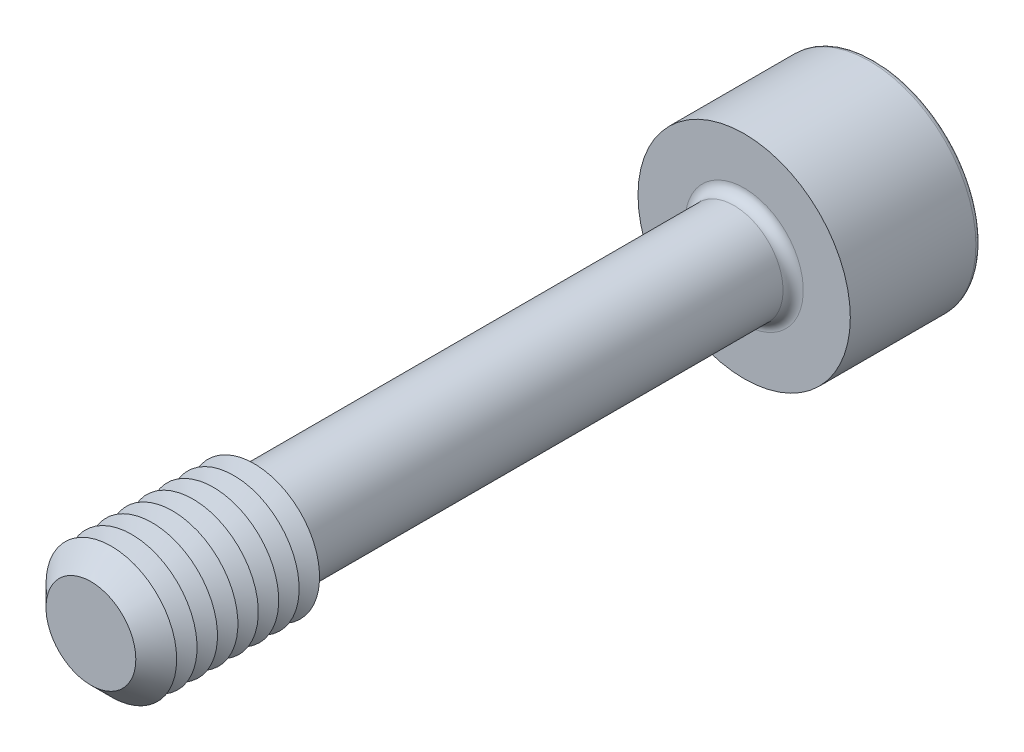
ISO-10303-21;
HEADER;
FILE_DESCRIPTION(('STEP AP214'),'2;1');
FILE_NAME('part.step','',(''),(''),'','','');
FILE_SCHEMA(('AUTOMOTIVE_DESIGN { 1 0 10303 214 1 1 1 1 }'));
ENDSEC;
DATA;
#1=APPLICATION_CONTEXT('core data for automotive mechanical design processes');
#2=APPLICATION_PROTOCOL_DEFINITION('international standard','automotive_design',2000,#1);
#3=PRODUCT_CONTEXT('',#1,'mechanical');
#4=PRODUCT('Part','Part','',(#3));
#5=PRODUCT_RELATED_PRODUCT_CATEGORY('part','',(#4));
#6=PRODUCT_DEFINITION_FORMATION('','',#4);
#7=PRODUCT_DEFINITION_CONTEXT('part definition',#1,'design');
#8=PRODUCT_DEFINITION('design','',#6,#7);
#9=PRODUCT_DEFINITION_SHAPE('','',#8);
#10=(LENGTH_UNIT() NAMED_UNIT(*) SI_UNIT(.MILLI.,.METRE.));
#11=(NAMED_UNIT(*) PLANE_ANGLE_UNIT() SI_UNIT($,.RADIAN.));
#12=(NAMED_UNIT(*) SI_UNIT($,.STERADIAN.) SOLID_ANGLE_UNIT());
#13=UNCERTAINTY_MEASURE_WITH_UNIT(LENGTH_MEASURE(1.E-05),#10,'distance_accuracy_value','');
#14=(GEOMETRIC_REPRESENTATION_CONTEXT(3) GLOBAL_UNCERTAINTY_ASSIGNED_CONTEXT((#13)) GLOBAL_UNIT_ASSIGNED_CONTEXT((#10,
#11,#12)) REPRESENTATION_CONTEXT('',''));
#15=CARTESIAN_POINT('',(0.,0.,0.));
#16=DIRECTION('',(0.,0.,1.));
#17=DIRECTION('',(1.,0.,0.));
#18=AXIS2_PLACEMENT_3D('',#15,#16,#17);
#19=CARTESIAN_POINT('',(-1.73205080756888,-3.,-22.));
#20=DIRECTION('',(0.,0.,1.));
#21=DIRECTION('',(1.,0.,0.));
#22=AXIS2_PLACEMENT_3D('',#19,#20,#21);
#23=PLANE('',#22);
#24=DIRECTION('',(1.,0.,0.));
#25=VECTOR('',#24,1.);
#26=CARTESIAN_POINT('',(-1.73205080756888,-3.,-22.));
#27=LINE('',#26,#25);
#28=CARTESIAN_POINT('',(0.,-3.,-22.));
#29=VERTEX_POINT('',#28);
#30=CARTESIAN_POINT('',(1.73205080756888,-3.,-22.));
#31=VERTEX_POINT('',#30);
#32=EDGE_CURVE('E404',#29,#31,#27,.T.);
#33=ORIENTED_EDGE('',*,*,#32,.F.);
#34=CARTESIAN_POINT('',(0.,0.,-22.));
#35=DIRECTION('',(0.,0.,1.));
#36=DIRECTION('',(0.,-1.,0.));
#37=AXIS2_PLACEMENT_3D('',#34,#35,#36);
#38=CIRCLE('',#37,3.);
#39=CARTESIAN_POINT('',(2.59807621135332,-1.5,-22.));
#40=VERTEX_POINT('',#39);
#41=EDGE_CURVE('E53',#29,#40,#38,.T.);
#42=ORIENTED_EDGE('',*,*,#41,.T.);
#43=DIRECTION('',(0.5,0.866025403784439,0.));
#44=VECTOR('',#43,1.);
#45=CARTESIAN_POINT('',(1.73205080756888,-3.,-22.));
#46=LINE('',#45,#44);
#47=EDGE_CURVE('E395',#31,#40,#46,.T.);
#48=ORIENTED_EDGE('',*,*,#47,.F.);
#49=EDGE_LOOP('',(#33,#42,#48));
#50=FACE_BOUND('',#49,.T.);
#51=ADVANCED_FACE('F41',(#50),#23,.F.);
#52=CARTESIAN_POINT('',(3.46410161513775,0.,-22.));
#53=VERTEX_POINT('',#52);
#54=EDGE_CURVE('E399',#40,#53,#46,.T.);
#55=ORIENTED_EDGE('',*,*,#54,.F.);
#56=CARTESIAN_POINT('',(2.59807621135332,1.5,-22.));
#57=VERTEX_POINT('',#56);
#58=EDGE_CURVE('E11',#40,#57,#38,.T.);
#59=ORIENTED_EDGE('',*,*,#58,.T.);
#60=DIRECTION('',(-0.5,0.866025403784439,0.));
#61=VECTOR('',#60,1.);
#62=CARTESIAN_POINT('',(3.46410161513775,0.,-22.));
#63=LINE('',#62,#61);
#64=EDGE_CURVE('E391',#53,#57,#63,.T.);
#65=ORIENTED_EDGE('',*,*,#64,.F.);
#66=EDGE_LOOP('',(#55,#59,#65));
#67=FACE_BOUND('',#66,.T.);
#68=ADVANCED_FACE('F133',(#67),#23,.F.);
#69=CARTESIAN_POINT('',(1.73205080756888,3.,-22.));
#70=VERTEX_POINT('',#69);
#71=EDGE_CURVE('E390',#57,#70,#63,.T.);
#72=ORIENTED_EDGE('',*,*,#71,.F.);
#73=CARTESIAN_POINT('',(0.,3.,-22.));
#74=VERTEX_POINT('',#73);
#75=EDGE_CURVE('E51',#57,#74,#38,.T.);
#76=ORIENTED_EDGE('',*,*,#75,.T.);
#77=DIRECTION('',(-1.,0.,0.));
#78=VECTOR('',#77,1.);
#79=CARTESIAN_POINT('',(1.73205080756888,3.,-22.));
#80=LINE('',#79,#78);
#81=EDGE_CURVE('E177',#70,#74,#80,.T.);
#82=ORIENTED_EDGE('',*,*,#81,.F.);
#83=EDGE_LOOP('',(#72,#76,#82));
#84=FACE_BOUND('',#83,.T.);
#85=ADVANCED_FACE('F139',(#84),#23,.F.);
#86=CARTESIAN_POINT('',(-1.73205080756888,3.,-22.));
#87=VERTEX_POINT('',#86);
#88=EDGE_CURVE('E396',#74,#87,#80,.T.);
#89=ORIENTED_EDGE('',*,*,#88,.F.);
#90=CARTESIAN_POINT('',(-2.59807621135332,1.5,-22.));
#91=VERTEX_POINT('',#90);
#92=EDGE_CURVE('E265',#74,#91,#38,.T.);
#93=ORIENTED_EDGE('',*,*,#92,.T.);
#94=DIRECTION('',(-0.5,-0.866025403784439,0.));
#95=VECTOR('',#94,1.);
#96=CARTESIAN_POINT('',(-1.73205080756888,3.,-22.));
#97=LINE('',#96,#95);
#98=EDGE_CURVE('E176',#87,#91,#97,.T.);
#99=ORIENTED_EDGE('',*,*,#98,.F.);
#100=EDGE_LOOP('',(#89,#93,#99));
#101=FACE_BOUND('',#100,.T.);
#102=ADVANCED_FACE('F157',(#101),#23,.F.);
#103=CARTESIAN_POINT('',(-3.46410161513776,0.,-22.));
#104=VERTEX_POINT('',#103);
#105=EDGE_CURVE('E170',#91,#104,#97,.T.);
#106=ORIENTED_EDGE('',*,*,#105,.F.);
#107=CARTESIAN_POINT('',(-2.59807621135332,-1.5,-22.));
#108=VERTEX_POINT('',#107);
#109=EDGE_CURVE('E172',#91,#108,#38,.T.);
#110=ORIENTED_EDGE('',*,*,#109,.T.);
#111=DIRECTION('',(0.5,-0.866025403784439,0.));
#112=VECTOR('',#111,1.);
#113=CARTESIAN_POINT('',(-3.46410161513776,0.,-22.));
#114=LINE('',#113,#112);
#115=EDGE_CURVE('E174',#104,#108,#114,.T.);
#116=ORIENTED_EDGE('',*,*,#115,.F.);
#117=EDGE_LOOP('',(#106,#110,#116));
#118=FACE_BOUND('',#117,.T.);
#119=ADVANCED_FACE('F146',(#118),#23,.F.);
#120=CARTESIAN_POINT('',(0.,0.,-28.));
#121=DIRECTION('',(0.,0.,-1.));
#122=DIRECTION('',(-1.,0.,0.));
#123=AXIS2_PLACEMENT_3D('',#120,#121,#122);
#124=PLANE('',#123);
#125=CARTESIAN_POINT('',(0.,0.,-28.));
#126=DIRECTION('',(0.,0.,-1.));
#127=DIRECTION('',(-1.,0.,0.));
#128=AXIS2_PLACEMENT_3D('',#125,#126,#127);
#129=CIRCLE('',#128,6.19);
#130=CARTESIAN_POINT('',(-6.19,0.,-28.));
#131=VERTEX_POINT('',#130);
#132=EDGE_CURVE('E248',#131,#131,#129,.T.);
#133=ORIENTED_EDGE('',*,*,#132,.T.);
#134=EDGE_LOOP('',(#133));
#135=FACE_BOUND('',#134,.T.);
#136=DIRECTION('',(-0.5,-0.866025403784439,0.));
#137=VECTOR('',#136,1.);
#138=CARTESIAN_POINT('',(-1.73205080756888,3.,-28.));
#139=LINE('',#138,#137);
#140=CARTESIAN_POINT('',(-1.73205080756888,3.,-28.));
#141=VERTEX_POINT('',#140);
#142=CARTESIAN_POINT('',(-3.46410161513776,0.,-28.));
#143=VERTEX_POINT('',#142);
#144=EDGE_CURVE('E212',#141,#143,#139,.T.);
#145=ORIENTED_EDGE('',*,*,#144,.T.);
#146=DIRECTION('',(0.5,-0.866025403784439,0.));
#147=VECTOR('',#146,1.);
#148=CARTESIAN_POINT('',(-3.46410161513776,0.,-28.));
#149=LINE('',#148,#147);
#150=CARTESIAN_POINT('',(-1.73205080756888,-3.,-28.));
#151=VERTEX_POINT('',#150);
#152=EDGE_CURVE('E67',#143,#151,#149,.T.);
#153=ORIENTED_EDGE('',*,*,#152,.T.);
#154=DIRECTION('',(1.,0.,0.));
#155=VECTOR('',#154,1.);
#156=CARTESIAN_POINT('',(-1.73205080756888,-3.,-28.));
#157=LINE('',#156,#155);
#158=CARTESIAN_POINT('',(1.73205080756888,-3.,-28.));
#159=VERTEX_POINT('',#158);
#160=EDGE_CURVE('E196',#151,#159,#157,.T.);
#161=ORIENTED_EDGE('',*,*,#160,.T.);
#162=DIRECTION('',(0.5,0.866025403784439,0.));
#163=VECTOR('',#162,1.);
#164=CARTESIAN_POINT('',(1.73205080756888,-3.,-28.));
#165=LINE('',#164,#163);
#166=CARTESIAN_POINT('',(3.46410161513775,0.,-28.));
#167=VERTEX_POINT('',#166);
#168=EDGE_CURVE('E200',#159,#167,#165,.T.);
#169=ORIENTED_EDGE('',*,*,#168,.T.);
#170=DIRECTION('',(-0.5,0.866025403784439,0.));
#171=VECTOR('',#170,1.);
#172=CARTESIAN_POINT('',(3.46410161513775,0.,-28.));
#173=LINE('',#172,#171);
#174=CARTESIAN_POINT('',(1.73205080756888,3.,-28.));
#175=VERTEX_POINT('',#174);
#176=EDGE_CURVE('E204',#167,#175,#173,.T.);
#177=ORIENTED_EDGE('',*,*,#176,.T.);
#178=DIRECTION('',(-1.,0.,0.));
#179=VECTOR('',#178,1.);
#180=CARTESIAN_POINT('',(1.73205080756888,3.,-28.));
#181=LINE('',#180,#179);
#182=EDGE_CURVE('E208',#175,#141,#181,.T.);
#183=ORIENTED_EDGE('',*,*,#182,.T.);
#184=EDGE_LOOP('',(#145,#153,#161,#169,#177,#183));
#185=FACE_BOUND('',#184,.T.);
#186=ADVANCED_FACE('F156',(#135,#185),#124,.T.);
#187=CARTESIAN_POINT('',(0.,0.,20.));
#188=DIRECTION('',(0.,0.,-1.));
#189=DIRECTION('',(-1.,0.,0.));
#190=AXIS2_PLACEMENT_3D('',#187,#188,#189);
#191=CYLINDRICAL_SURFACE('',#190,3.);
#192=CARTESIAN_POINT('',(0.,0.,-19.38));
#193=DIRECTION('',(0.,0.,-1.));
#194=DIRECTION('',(-1.,0.,0.));
#195=AXIS2_PLACEMENT_3D('',#192,#193,#194);
#196=CIRCLE('',#195,3.);
#197=CARTESIAN_POINT('',(-3.,0.,-19.38));
#198=VERTEX_POINT('',#197);
#199=EDGE_CURVE('E246',#198,#198,#196,.F.);
#200=ORIENTED_EDGE('',*,*,#199,.T.);
#201=EDGE_LOOP('',(#200));
#202=FACE_BOUND('',#201,.T.);
#203=CARTESIAN_POINT('',(0.,0.,9.42264973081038));
#204=DIRECTION('',(0.,0.,-1.));
#205=DIRECTION('',(0.,1.,0.));
#206=AXIS2_PLACEMENT_3D('',#203,#204,#205);
#207=CIRCLE('',#206,3.);
#208=CARTESIAN_POINT('',(0.,3.,9.42264973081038));
#209=VERTEX_POINT('',#208);
#210=EDGE_CURVE('E234',#209,#209,#207,.T.);
#211=ORIENTED_EDGE('',*,*,#210,.T.);
#212=EDGE_LOOP('',(#211));
#213=FACE_BOUND('',#212,.T.);
#214=ADVANCED_FACE('F163',(#202,#213),#191,.T.);
#215=CARTESIAN_POINT('',(0.,0.,9.42264973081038));
#216=DIRECTION('',(0.,0.,1.));
#217=DIRECTION('',(0.,-1.,0.));
#218=AXIS2_PLACEMENT_3D('',#215,#216,#217);
#219=CONICAL_SURFACE('',#218,3.,1.0471975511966);
#220=CARTESIAN_POINT('',(0.,0.,10.));
#221=DIRECTION('',(0.,0.,-1.));
#222=DIRECTION('',(-1.,0.,0.));
#223=AXIS2_PLACEMENT_3D('',#220,#221,#222);
#224=CIRCLE('',#223,4.);
#225=CARTESIAN_POINT('',(-4.,0.,10.));
#226=VERTEX_POINT('',#225);
#227=EDGE_CURVE('E269',#226,#226,#224,.T.);
#228=ORIENTED_EDGE('',*,*,#227,.T.);
#229=EDGE_LOOP('',(#228));
#230=FACE_BOUND('',#229,.T.);
#231=ORIENTED_EDGE('',*,*,#210,.F.);
#232=EDGE_LOOP('',(#231));
#233=FACE_BOUND('',#232,.T.);
#234=ADVANCED_FACE('F348',(#230,#233),#219,.T.);
#235=CARTESIAN_POINT('',(0.,0.,-20.));
#236=DIRECTION('',(0.,0.,-1.));
#237=DIRECTION('',(-1.,0.,0.));
#238=AXIS2_PLACEMENT_3D('',#235,#236,#237);
#239=PLANE('',#238);
#240=CARTESIAN_POINT('',(0.,0.,-20.));
#241=DIRECTION('',(0.,0.,-1.));
#242=DIRECTION('',(-1.,0.,0.));
#243=AXIS2_PLACEMENT_3D('',#240,#241,#242);
#244=CIRCLE('',#243,3.62);
#245=CARTESIAN_POINT('',(-3.62,0.,-20.));
#246=VERTEX_POINT('',#245);
#247=EDGE_CURVE('E242',#246,#246,#244,.T.);
#248=ORIENTED_EDGE('',*,*,#247,.T.);
#249=EDGE_LOOP('',(#248));
#250=FACE_BOUND('',#249,.T.);
#251=CARTESIAN_POINT('',(0.,0.,-20.));
#252=DIRECTION('',(0.,0.,-1.));
#253=DIRECTION('',(-1.,0.,0.));
#254=AXIS2_PLACEMENT_3D('',#251,#252,#253);
#255=CIRCLE('',#254,6.5);
#256=CARTESIAN_POINT('',(-6.5,0.,-20.));
#257=VERTEX_POINT('',#256);
#258=EDGE_CURVE('E230',#257,#257,#255,.T.);
#259=ORIENTED_EDGE('',*,*,#258,.F.);
#260=EDGE_LOOP('',(#259));
#261=FACE_BOUND('',#260,.T.);
#262=ADVANCED_FACE('F353',(#250,#261),#239,.F.);
#263=CARTESIAN_POINT('',(0.,0.,-28.));
#264=DIRECTION('',(0.,0.,1.));
#265=DIRECTION('',(1.,0.,0.));
#266=AXIS2_PLACEMENT_3D('',#263,#264,#265);
#267=CYLINDRICAL_SURFACE('',#266,6.5);
#268=CARTESIAN_POINT('',(0.,0.,-27.69));
#269=DIRECTION('',(0.,0.,-1.));
#270=DIRECTION('',(-1.,0.,0.));
#271=AXIS2_PLACEMENT_3D('',#268,#269,#270);
#272=CIRCLE('',#271,6.5);
#273=CARTESIAN_POINT('',(-6.5,0.,-27.69));
#274=VERTEX_POINT('',#273);
#275=EDGE_CURVE('E45',#274,#274,#272,.F.);
#276=ORIENTED_EDGE('',*,*,#275,.T.);
#277=EDGE_LOOP('',(#276));
#278=FACE_BOUND('',#277,.T.);
#279=ORIENTED_EDGE('',*,*,#258,.T.);
#280=EDGE_LOOP('',(#279));
#281=FACE_BOUND('',#280,.T.);
#282=ADVANCED_FACE('F354',(#278,#281),#267,.T.);
#283=CARTESIAN_POINT('',(-3.46410161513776,0.,-22.));
#284=DIRECTION('',(0.866025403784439,0.5,0.));
#285=DIRECTION('',(-0.5,0.866025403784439,0.));
#286=AXIS2_PLACEMENT_3D('',#283,#284,#285);
#287=PLANE('',#286);
#288=ORIENTED_EDGE('',*,*,#152,.F.);
#289=DIRECTION('',(0.,0.,-1.));
#290=VECTOR('',#289,1.);
#291=CARTESIAN_POINT('',(-3.46410161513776,0.,-22.));
#292=LINE('',#291,#290);
#293=EDGE_CURVE('E186',#104,#143,#292,.T.);
#294=ORIENTED_EDGE('',*,*,#293,.F.);
#295=ORIENTED_EDGE('',*,*,#115,.T.);
#296=CARTESIAN_POINT('',(-1.73205080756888,-3.,-22.));
#297=VERTEX_POINT('',#296);
#298=EDGE_CURVE('E215',#108,#297,#114,.T.);
#299=ORIENTED_EDGE('',*,*,#298,.T.);
#300=DIRECTION('',(0.,0.,-1.));
#301=VECTOR('',#300,1.);
#302=CARTESIAN_POINT('',(-1.73205080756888,-3.,-22.));
#303=LINE('',#302,#301);
#304=EDGE_CURVE('E227',#297,#151,#303,.T.);
#305=ORIENTED_EDGE('',*,*,#304,.T.);
#306=EDGE_LOOP('',(#288,#294,#295,#299,#305));
#307=FACE_BOUND('',#306,.T.);
#308=ADVANCED_FACE('F357',(#307),#287,.T.);
#309=CARTESIAN_POINT('',(-1.73205080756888,-3.,-22.));
#310=DIRECTION('',(0.,1.,0.));
#311=DIRECTION('',(0.,0.,1.));
#312=AXIS2_PLACEMENT_3D('',#309,#310,#311);
#313=PLANE('',#312);
#314=ORIENTED_EDGE('',*,*,#160,.F.);
#315=ORIENTED_EDGE('',*,*,#304,.F.);
#316=EDGE_CURVE('E402',#297,#29,#27,.T.);
#317=ORIENTED_EDGE('',*,*,#316,.T.);
#318=ORIENTED_EDGE('',*,*,#32,.T.);
#319=DIRECTION('',(0.,0.,-1.));
#320=VECTOR('',#319,1.);
#321=CARTESIAN_POINT('',(1.73205080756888,-3.,-22.));
#322=LINE('',#321,#320);
#323=EDGE_CURVE('E224',#31,#159,#322,.T.);
#324=ORIENTED_EDGE('',*,*,#323,.T.);
#325=EDGE_LOOP('',(#314,#315,#317,#318,#324));
#326=FACE_BOUND('',#325,.T.);
#327=ADVANCED_FACE('F363',(#326),#313,.T.);
#328=CARTESIAN_POINT('',(1.73205080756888,-3.,-22.));
#329=DIRECTION('',(-0.866025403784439,0.5,0.));
#330=DIRECTION('',(-0.5,-0.866025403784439,0.));
#331=AXIS2_PLACEMENT_3D('',#328,#329,#330);
#332=PLANE('',#331);
#333=ORIENTED_EDGE('',*,*,#168,.F.);
#334=ORIENTED_EDGE('',*,*,#323,.F.);
#335=ORIENTED_EDGE('',*,*,#47,.T.);
#336=ORIENTED_EDGE('',*,*,#54,.T.);
#337=DIRECTION('',(0.,0.,-1.));
#338=VECTOR('',#337,1.);
#339=CARTESIAN_POINT('',(3.46410161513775,0.,-22.));
#340=LINE('',#339,#338);
#341=EDGE_CURVE('E221',#53,#167,#340,.T.);
#342=ORIENTED_EDGE('',*,*,#341,.T.);
#343=EDGE_LOOP('',(#333,#334,#335,#336,#342));
#344=FACE_BOUND('',#343,.T.);
#345=ADVANCED_FACE('F366',(#344),#332,.T.);
#346=CARTESIAN_POINT('',(3.46410161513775,0.,-22.));
#347=DIRECTION('',(-0.866025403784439,-0.5,0.));
#348=DIRECTION('',(0.5,-0.866025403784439,0.));
#349=AXIS2_PLACEMENT_3D('',#346,#347,#348);
#350=PLANE('',#349);
#351=ORIENTED_EDGE('',*,*,#176,.F.);
#352=ORIENTED_EDGE('',*,*,#341,.F.);
#353=ORIENTED_EDGE('',*,*,#64,.T.);
#354=ORIENTED_EDGE('',*,*,#71,.T.);
#355=DIRECTION('',(0.,0.,-1.));
#356=VECTOR('',#355,1.);
#357=CARTESIAN_POINT('',(1.73205080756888,3.,-22.));
#358=LINE('',#357,#356);
#359=EDGE_CURVE('E218',#70,#175,#358,.T.);
#360=ORIENTED_EDGE('',*,*,#359,.T.);
#361=EDGE_LOOP('',(#351,#352,#353,#354,#360));
#362=FACE_BOUND('',#361,.T.);
#363=ADVANCED_FACE('F370',(#362),#350,.T.);
#364=CARTESIAN_POINT('',(1.73205080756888,3.,-22.));
#365=DIRECTION('',(0.,-1.,0.));
#366=DIRECTION('',(1.,0.,0.));
#367=AXIS2_PLACEMENT_3D('',#364,#365,#366);
#368=PLANE('',#367);
#369=ORIENTED_EDGE('',*,*,#182,.F.);
#370=ORIENTED_EDGE('',*,*,#359,.F.);
#371=ORIENTED_EDGE('',*,*,#81,.T.);
#372=ORIENTED_EDGE('',*,*,#88,.T.);
#373=DIRECTION('',(0.,0.,-1.));
#374=VECTOR('',#373,1.);
#375=CARTESIAN_POINT('',(-1.73205080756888,3.,-22.));
#376=LINE('',#375,#374);
#377=EDGE_CURVE('E182',#87,#141,#376,.T.);
#378=ORIENTED_EDGE('',*,*,#377,.T.);
#379=EDGE_LOOP('',(#369,#370,#371,#372,#378));
#380=FACE_BOUND('',#379,.T.);
#381=ADVANCED_FACE('F152',(#380),#368,.T.);
#382=CARTESIAN_POINT('',(-1.73205080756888,3.,-22.));
#383=DIRECTION('',(0.866025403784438,-0.5,0.));
#384=DIRECTION('',(0.5,0.866025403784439,0.));
#385=AXIS2_PLACEMENT_3D('',#382,#383,#384);
#386=PLANE('',#385);
#387=ORIENTED_EDGE('',*,*,#144,.F.);
#388=ORIENTED_EDGE('',*,*,#377,.F.);
#389=ORIENTED_EDGE('',*,*,#98,.T.);
#390=ORIENTED_EDGE('',*,*,#105,.T.);
#391=ORIENTED_EDGE('',*,*,#293,.T.);
#392=EDGE_LOOP('',(#387,#388,#389,#390,#391));
#393=FACE_BOUND('',#392,.T.);
#394=ADVANCED_FACE('F144',(#393),#386,.T.);
#395=ORIENTED_EDGE('',*,*,#298,.F.);
#396=EDGE_CURVE('E256',#108,#29,#38,.T.);
#397=ORIENTED_EDGE('',*,*,#396,.T.);
#398=ORIENTED_EDGE('',*,*,#316,.F.);
#399=EDGE_LOOP('',(#395,#397,#398));
#400=FACE_BOUND('',#399,.T.);
#401=ADVANCED_FACE('F135',(#400),#23,.F.);
#402=CARTESIAN_POINT('',(0.,0.,-19.38));
#403=DIRECTION('',(0.,0.,-1.));
#404=DIRECTION('',(-1.,0.,0.));
#405=AXIS2_PLACEMENT_3D('',#402,#403,#404);
#406=TOROIDAL_SURFACE('',#405,3.62,0.62);
#407=ORIENTED_EDGE('',*,*,#199,.F.);
#408=EDGE_LOOP('',(#407));
#409=FACE_BOUND('',#408,.T.);
#410=ORIENTED_EDGE('',*,*,#247,.F.);
#411=EDGE_LOOP('',(#410));
#412=FACE_BOUND('',#411,.T.);
#413=ADVANCED_FACE('F129',(#409,#412),#406,.F.);
#414=CARTESIAN_POINT('',(0.,0.,-27.69));
#415=DIRECTION('',(0.,0.,-1.));
#416=DIRECTION('',(-1.,0.,0.));
#417=AXIS2_PLACEMENT_3D('',#414,#415,#416);
#418=TOROIDAL_SURFACE('',#417,6.19,0.31);
#419=ORIENTED_EDGE('',*,*,#275,.F.);
#420=EDGE_LOOP('',(#419));
#421=FACE_BOUND('',#420,.T.);
#422=ORIENTED_EDGE('',*,*,#132,.F.);
#423=EDGE_LOOP('',(#422));
#424=FACE_BOUND('',#423,.T.);
#425=ADVANCED_FACE('F43',(#421,#424),#418,.T.);
#426=CARTESIAN_POINT('',(0.,0.,-20.2679491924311));
#427=DIRECTION('',(0.,0.,-1.));
#428=DIRECTION('',(0.,1.,0.));
#429=AXIS2_PLACEMENT_3D('',#426,#427,#428);
#430=CONICAL_SURFACE('',#429,0.,1.0471975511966);
#431=ORIENTED_EDGE('',*,*,#41,.F.);
#432=ORIENTED_EDGE('',*,*,#396,.F.);
#433=ORIENTED_EDGE('',*,*,#109,.F.);
#434=ORIENTED_EDGE('',*,*,#92,.F.);
#435=ORIENTED_EDGE('',*,*,#75,.F.);
#436=ORIENTED_EDGE('',*,*,#58,.F.);
#437=EDGE_LOOP('',(#431,#432,#433,#434,#435,#436));
#438=FACE_BOUND('',#437,.T.);
#439=CARTESIAN_POINT('',(0.,0.,-20.2679491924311));
#440=VERTEX_POINT('',#439);
#441=VERTEX_LOOP('',#440);
#442=FACE_BOUND('',#441,.T.);
#443=ADVANCED_FACE('F118',(#438,#442),#430,.F.);
#444=CARTESIAN_POINT('',(0.,0.,10.625));
#445=DIRECTION('',(0.,0.,-1.));
#446=DIRECTION('',(-1.,0.,0.));
#447=AXIS2_PLACEMENT_3D('',#444,#445,#446);
#448=CONICAL_SURFACE('',#447,2.91746824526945,1.0471975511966);
#449=ORIENTED_EDGE('',*,*,#227,.F.);
#450=EDGE_LOOP('',(#449));
#451=FACE_BOUND('',#450,.T.);
#452=CARTESIAN_POINT('',(0.,0.,10.625));
#453=DIRECTION('',(0.,0.,-1.));
#454=DIRECTION('',(-1.,0.,0.));
#455=AXIS2_PLACEMENT_3D('',#452,#453,#454);
#456=CIRCLE('',#455,2.91746824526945);
#457=CARTESIAN_POINT('',(-2.91746824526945,0.,10.625));
#458=VERTEX_POINT('',#457);
#459=EDGE_CURVE('E274',#458,#458,#456,.T.);
#460=ORIENTED_EDGE('',*,*,#459,.T.);
#461=EDGE_LOOP('',(#460));
#462=FACE_BOUND('',#461,.T.);
#463=ADVANCED_FACE('F120',(#451,#462),#448,.T.);
#464=CARTESIAN_POINT('',(0.,0.,11.25));
#465=DIRECTION('',(0.,0.,1.));
#466=DIRECTION('',(1.,0.,0.));
#467=AXIS2_PLACEMENT_3D('',#464,#465,#466);
#468=CONICAL_SURFACE('',#467,4.,1.0471975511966);
#469=ORIENTED_EDGE('',*,*,#459,.F.);
#470=EDGE_LOOP('',(#469));
#471=FACE_BOUND('',#470,.T.);
#472=CARTESIAN_POINT('',(0.,0.,11.25));
#473=DIRECTION('',(0.,0.,-1.));
#474=DIRECTION('',(-1.,0.,0.));
#475=AXIS2_PLACEMENT_3D('',#472,#473,#474);
#476=CIRCLE('',#475,4.);
#477=CARTESIAN_POINT('',(-4.,0.,11.25));
#478=VERTEX_POINT('',#477);
#479=EDGE_CURVE('E280',#478,#478,#476,.T.);
#480=ORIENTED_EDGE('',*,*,#479,.T.);
#481=EDGE_LOOP('',(#480));
#482=FACE_BOUND('',#481,.T.);
#483=ADVANCED_FACE('F126',(#471,#482),#468,.T.);
#484=CARTESIAN_POINT('',(0.,0.,11.875));
#485=DIRECTION('',(0.,0.,-1.));
#486=DIRECTION('',(-1.,0.,0.));
#487=AXIS2_PLACEMENT_3D('',#484,#485,#486);
#488=CONICAL_SURFACE('',#487,2.91746824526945,1.0471975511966);
#489=ORIENTED_EDGE('',*,*,#479,.F.);
#490=EDGE_LOOP('',(#489));
#491=FACE_BOUND('',#490,.T.);
#492=CARTESIAN_POINT('',(0.,0.,11.875));
#493=DIRECTION('',(0.,0.,-1.));
#494=DIRECTION('',(-1.,0.,0.));
#495=AXIS2_PLACEMENT_3D('',#492,#493,#494);
#496=CIRCLE('',#495,2.91746824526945);
#497=CARTESIAN_POINT('',(-2.91746824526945,0.,11.875));
#498=VERTEX_POINT('',#497);
#499=EDGE_CURVE('E286',#498,#498,#496,.T.);
#500=ORIENTED_EDGE('',*,*,#499,.T.);
#501=EDGE_LOOP('',(#500));
#502=FACE_BOUND('',#501,.T.);
#503=ADVANCED_FACE('F508',(#491,#502),#488,.T.);
#504=CARTESIAN_POINT('',(0.,0.,12.5));
#505=DIRECTION('',(0.,0.,1.));
#506=DIRECTION('',(1.,0.,0.));
#507=AXIS2_PLACEMENT_3D('',#504,#505,#506);
#508=CONICAL_SURFACE('',#507,4.,1.0471975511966);
#509=ORIENTED_EDGE('',*,*,#499,.F.);
#510=EDGE_LOOP('',(#509));
#511=FACE_BOUND('',#510,.T.);
#512=CARTESIAN_POINT('',(0.,0.,12.5));
#513=DIRECTION('',(0.,0.,-1.));
#514=DIRECTION('',(-1.,0.,0.));
#515=AXIS2_PLACEMENT_3D('',#512,#513,#514);
#516=CIRCLE('',#515,4.);
#517=CARTESIAN_POINT('',(-4.,0.,12.5));
#518=VERTEX_POINT('',#517);
#519=EDGE_CURVE('E290',#518,#518,#516,.T.);
#520=ORIENTED_EDGE('',*,*,#519,.T.);
#521=EDGE_LOOP('',(#520));
#522=FACE_BOUND('',#521,.T.);
#523=ADVANCED_FACE('F517',(#511,#522),#508,.T.);
#524=CARTESIAN_POINT('',(0.,0.,13.125));
#525=DIRECTION('',(0.,0.,-1.));
#526=DIRECTION('',(-1.,0.,0.));
#527=AXIS2_PLACEMENT_3D('',#524,#525,#526);
#528=CONICAL_SURFACE('',#527,2.91746824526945,1.0471975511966);
#529=ORIENTED_EDGE('',*,*,#519,.F.);
#530=EDGE_LOOP('',(#529));
#531=FACE_BOUND('',#530,.T.);
#532=CARTESIAN_POINT('',(0.,0.,13.125));
#533=DIRECTION('',(0.,0.,-1.));
#534=DIRECTION('',(-1.,0.,0.));
#535=AXIS2_PLACEMENT_3D('',#532,#533,#534);
#536=CIRCLE('',#535,2.91746824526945);
#537=CARTESIAN_POINT('',(-2.91746824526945,0.,13.125));
#538=VERTEX_POINT('',#537);
#539=EDGE_CURVE('E293',#538,#538,#536,.T.);
#540=ORIENTED_EDGE('',*,*,#539,.T.);
#541=EDGE_LOOP('',(#540));
#542=FACE_BOUND('',#541,.T.);
#543=ADVANCED_FACE('F526',(#531,#542),#528,.T.);
#544=CARTESIAN_POINT('',(0.,0.,13.75));
#545=DIRECTION('',(0.,0.,1.));
#546=DIRECTION('',(1.,0.,0.));
#547=AXIS2_PLACEMENT_3D('',#544,#545,#546);
#548=CONICAL_SURFACE('',#547,4.,1.0471975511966);
#549=ORIENTED_EDGE('',*,*,#539,.F.);
#550=EDGE_LOOP('',(#549));
#551=FACE_BOUND('',#550,.T.);
#552=CARTESIAN_POINT('',(0.,0.,13.75));
#553=DIRECTION('',(0.,0.,-1.));
#554=DIRECTION('',(-1.,0.,0.));
#555=AXIS2_PLACEMENT_3D('',#552,#553,#554);
#556=CIRCLE('',#555,4.);
#557=CARTESIAN_POINT('',(-4.,0.,13.75));
#558=VERTEX_POINT('',#557);
#559=EDGE_CURVE('E297',#558,#558,#556,.T.);
#560=ORIENTED_EDGE('',*,*,#559,.T.);
#561=EDGE_LOOP('',(#560));
#562=FACE_BOUND('',#561,.T.);
#563=ADVANCED_FACE('F535',(#551,#562),#548,.T.);
#564=CARTESIAN_POINT('',(0.,0.,14.375));
#565=DIRECTION('',(0.,0.,-1.));
#566=DIRECTION('',(-1.,0.,0.));
#567=AXIS2_PLACEMENT_3D('',#564,#565,#566);
#568=CONICAL_SURFACE('',#567,2.91746824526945,1.0471975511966);
#569=ORIENTED_EDGE('',*,*,#559,.F.);
#570=EDGE_LOOP('',(#569));
#571=FACE_BOUND('',#570,.T.);
#572=CARTESIAN_POINT('',(0.,0.,14.375));
#573=DIRECTION('',(0.,0.,-1.));
#574=DIRECTION('',(-1.,0.,0.));
#575=AXIS2_PLACEMENT_3D('',#572,#573,#574);
#576=CIRCLE('',#575,2.91746824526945);
#577=CARTESIAN_POINT('',(-2.91746824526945,0.,14.375));
#578=VERTEX_POINT('',#577);
#579=EDGE_CURVE('E301',#578,#578,#576,.T.);
#580=ORIENTED_EDGE('',*,*,#579,.T.);
#581=EDGE_LOOP('',(#580));
#582=FACE_BOUND('',#581,.T.);
#583=ADVANCED_FACE('F544',(#571,#582),#568,.T.);
#584=CARTESIAN_POINT('',(0.,0.,15.));
#585=DIRECTION('',(0.,0.,1.));
#586=DIRECTION('',(1.,0.,0.));
#587=AXIS2_PLACEMENT_3D('',#584,#585,#586);
#588=CONICAL_SURFACE('',#587,4.,1.0471975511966);
#589=ORIENTED_EDGE('',*,*,#579,.F.);
#590=EDGE_LOOP('',(#589));
#591=FACE_BOUND('',#590,.T.);
#592=CARTESIAN_POINT('',(0.,0.,15.));
#593=DIRECTION('',(0.,0.,-1.));
#594=DIRECTION('',(-1.,0.,0.));
#595=AXIS2_PLACEMENT_3D('',#592,#593,#594);
#596=CIRCLE('',#595,4.);
#597=CARTESIAN_POINT('',(-4.,0.,15.));
#598=VERTEX_POINT('',#597);
#599=EDGE_CURVE('E305',#598,#598,#596,.T.);
#600=ORIENTED_EDGE('',*,*,#599,.T.);
#601=EDGE_LOOP('',(#600));
#602=FACE_BOUND('',#601,.T.);
#603=ADVANCED_FACE('F553',(#591,#602),#588,.T.);
#604=CARTESIAN_POINT('',(0.,0.,15.625));
#605=DIRECTION('',(0.,0.,-1.));
#606=DIRECTION('',(-1.,0.,0.));
#607=AXIS2_PLACEMENT_3D('',#604,#605,#606);
#608=CONICAL_SURFACE('',#607,2.91746824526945,1.0471975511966);
#609=ORIENTED_EDGE('',*,*,#599,.F.);
#610=EDGE_LOOP('',(#609));
#611=FACE_BOUND('',#610,.T.);
#612=CARTESIAN_POINT('',(0.,0.,15.625));
#613=DIRECTION('',(0.,0.,-1.));
#614=DIRECTION('',(-1.,0.,0.));
#615=AXIS2_PLACEMENT_3D('',#612,#613,#614);
#616=CIRCLE('',#615,2.91746824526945);
#617=CARTESIAN_POINT('',(-2.91746824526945,0.,15.625));
#618=VERTEX_POINT('',#617);
#619=EDGE_CURVE('E308',#618,#618,#616,.T.);
#620=ORIENTED_EDGE('',*,*,#619,.T.);
#621=EDGE_LOOP('',(#620));
#622=FACE_BOUND('',#621,.T.);
#623=ADVANCED_FACE('F562',(#611,#622),#608,.T.);
#624=CARTESIAN_POINT('',(0.,0.,16.25));
#625=DIRECTION('',(0.,0.,1.));
#626=DIRECTION('',(1.,0.,0.));
#627=AXIS2_PLACEMENT_3D('',#624,#625,#626);
#628=CONICAL_SURFACE('',#627,4.,1.0471975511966);
#629=ORIENTED_EDGE('',*,*,#619,.F.);
#630=EDGE_LOOP('',(#629));
#631=FACE_BOUND('',#630,.T.);
#632=CARTESIAN_POINT('',(0.,0.,16.25));
#633=DIRECTION('',(0.,0.,-1.));
#634=DIRECTION('',(-1.,0.,0.));
#635=AXIS2_PLACEMENT_3D('',#632,#633,#634);
#636=CIRCLE('',#635,4.);
#637=CARTESIAN_POINT('',(-4.,0.,16.25));
#638=VERTEX_POINT('',#637);
#639=EDGE_CURVE('E312',#638,#638,#636,.T.);
#640=ORIENTED_EDGE('',*,*,#639,.T.);
#641=EDGE_LOOP('',(#640));
#642=FACE_BOUND('',#641,.T.);
#643=ADVANCED_FACE('F571',(#631,#642),#628,.T.);
#644=CARTESIAN_POINT('',(0.,0.,16.875));
#645=DIRECTION('',(0.,0.,-1.));
#646=DIRECTION('',(-1.,0.,0.));
#647=AXIS2_PLACEMENT_3D('',#644,#645,#646);
#648=CONICAL_SURFACE('',#647,2.91746824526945,1.0471975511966);
#649=ORIENTED_EDGE('',*,*,#639,.F.);
#650=EDGE_LOOP('',(#649));
#651=FACE_BOUND('',#650,.T.);
#652=CARTESIAN_POINT('',(0.,0.,16.875));
#653=DIRECTION('',(0.,0.,-1.));
#654=DIRECTION('',(-1.,0.,0.));
#655=AXIS2_PLACEMENT_3D('',#652,#653,#654);
#656=CIRCLE('',#655,2.91746824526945);
#657=CARTESIAN_POINT('',(-2.91746824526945,0.,16.875));
#658=VERTEX_POINT('',#657);
#659=EDGE_CURVE('E316',#658,#658,#656,.T.);
#660=ORIENTED_EDGE('',*,*,#659,.T.);
#661=EDGE_LOOP('',(#660));
#662=FACE_BOUND('',#661,.T.);
#663=ADVANCED_FACE('F580',(#651,#662),#648,.T.);
#664=CARTESIAN_POINT('',(0.,0.,17.5));
#665=DIRECTION('',(0.,0.,1.));
#666=DIRECTION('',(1.,0.,0.));
#667=AXIS2_PLACEMENT_3D('',#664,#665,#666);
#668=CONICAL_SURFACE('',#667,4.,1.0471975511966);
#669=ORIENTED_EDGE('',*,*,#659,.F.);
#670=EDGE_LOOP('',(#669));
#671=FACE_BOUND('',#670,.T.);
#672=CARTESIAN_POINT('',(0.,0.,17.5));
#673=DIRECTION('',(0.,0.,-1.));
#674=DIRECTION('',(-1.,0.,0.));
#675=AXIS2_PLACEMENT_3D('',#672,#673,#674);
#676=CIRCLE('',#675,4.);
#677=CARTESIAN_POINT('',(-4.,0.,17.5));
#678=VERTEX_POINT('',#677);
#679=EDGE_CURVE('E320',#678,#678,#676,.T.);
#680=ORIENTED_EDGE('',*,*,#679,.T.);
#681=EDGE_LOOP('',(#680));
#682=FACE_BOUND('',#681,.T.);
#683=ADVANCED_FACE('F589',(#671,#682),#668,.T.);
#684=CARTESIAN_POINT('',(0.,0.,18.125));
#685=DIRECTION('',(0.,0.,-1.));
#686=DIRECTION('',(-1.,0.,0.));
#687=AXIS2_PLACEMENT_3D('',#684,#685,#686);
#688=CONICAL_SURFACE('',#687,2.91746824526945,1.0471975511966);
#689=ORIENTED_EDGE('',*,*,#679,.F.);
#690=EDGE_LOOP('',(#689));
#691=FACE_BOUND('',#690,.T.);
#692=CARTESIAN_POINT('',(0.,0.,18.125));
#693=DIRECTION('',(0.,0.,-1.));
#694=DIRECTION('',(-1.,0.,0.));
#695=AXIS2_PLACEMENT_3D('',#692,#693,#694);
#696=CIRCLE('',#695,2.91746824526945);
#697=CARTESIAN_POINT('',(-2.91746824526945,0.,18.125));
#698=VERTEX_POINT('',#697);
#699=EDGE_CURVE('E324',#698,#698,#696,.T.);
#700=ORIENTED_EDGE('',*,*,#699,.T.);
#701=EDGE_LOOP('',(#700));
#702=FACE_BOUND('',#701,.T.);
#703=ADVANCED_FACE('F598',(#691,#702),#688,.T.);
#704=CARTESIAN_POINT('',(0.,0.,18.75));
#705=DIRECTION('',(0.,0.,1.));
#706=DIRECTION('',(1.,0.,0.));
#707=AXIS2_PLACEMENT_3D('',#704,#705,#706);
#708=CONICAL_SURFACE('',#707,4.,1.0471975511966);
#709=ORIENTED_EDGE('',*,*,#699,.F.);
#710=EDGE_LOOP('',(#709));
#711=FACE_BOUND('',#710,.T.);
#712=CARTESIAN_POINT('',(0.,0.,18.75));
#713=DIRECTION('',(0.,0.,-1.));
#714=DIRECTION('',(-1.,0.,0.));
#715=AXIS2_PLACEMENT_3D('',#712,#713,#714);
#716=CIRCLE('',#715,4.);
#717=CARTESIAN_POINT('',(-4.,0.,18.75));
#718=VERTEX_POINT('',#717);
#719=EDGE_CURVE('E328',#718,#718,#716,.T.);
#720=ORIENTED_EDGE('',*,*,#719,.T.);
#721=EDGE_LOOP('',(#720));
#722=FACE_BOUND('',#721,.T.);
#723=ADVANCED_FACE('F333',(#711,#722),#708,.T.);
#724=CARTESIAN_POINT('',(0.,0.,20.));
#725=DIRECTION('',(0.,0.,1.));
#726=DIRECTION('',(1.,0.,0.));
#727=AXIS2_PLACEMENT_3D('',#724,#725,#726);
#728=PLANE('',#727);
#729=CARTESIAN_POINT('',(0.,0.,20.));
#730=DIRECTION('',(0.,0.,1.));
#731=DIRECTION('',(1.,0.,0.));
#732=AXIS2_PLACEMENT_3D('',#729,#730,#731);
#733=CIRCLE('',#732,2.74999999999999);
#734=CARTESIAN_POINT('',(2.74999999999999,0.,20.));
#735=VERTEX_POINT('',#734);
#736=EDGE_CURVE('E238',#735,#735,#733,.T.);
#737=ORIENTED_EDGE('',*,*,#736,.T.);
#738=EDGE_LOOP('',(#737));
#739=FACE_BOUND('',#738,.T.);
#740=ADVANCED_FACE('F337',(#739),#728,.T.);
#741=CARTESIAN_POINT('',(0.,0.,18.75));
#742=DIRECTION('',(0.,0.,-1.));
#743=DIRECTION('',(0.,1.,0.));
#744=AXIS2_PLACEMENT_3D('',#741,#742,#743);
#745=CONICAL_SURFACE('',#744,4.,0.78539816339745);
#746=ORIENTED_EDGE('',*,*,#736,.F.);
#747=EDGE_LOOP('',(#746));
#748=FACE_BOUND('',#747,.T.);
#749=ORIENTED_EDGE('',*,*,#719,.F.);
#750=EDGE_LOOP('',(#749));
#751=FACE_BOUND('',#750,.T.);
#752=ADVANCED_FACE('F335',(#748,#751),#745,.T.);
#753=CLOSED_SHELL('',(#51,#68,#85,#102,#119,#186,#214,#234,#262,#282,#308,#327,#345,#363,#381,
#394,#401,#413,#425,#443,#463,#483,#503,#523,#543,#563,#583,#603,#623,#643,#663,#683,#703,#723,
#740,#752));
#754=MANIFOLD_SOLID_BREP('B2',#753);
#755=ADVANCED_BREP_SHAPE_REPRESENTATION('',(#18,#754),#14);
#756=SHAPE_DEFINITION_REPRESENTATION(#9,#755);
ENDSEC;
END-ISO-10303-21;
